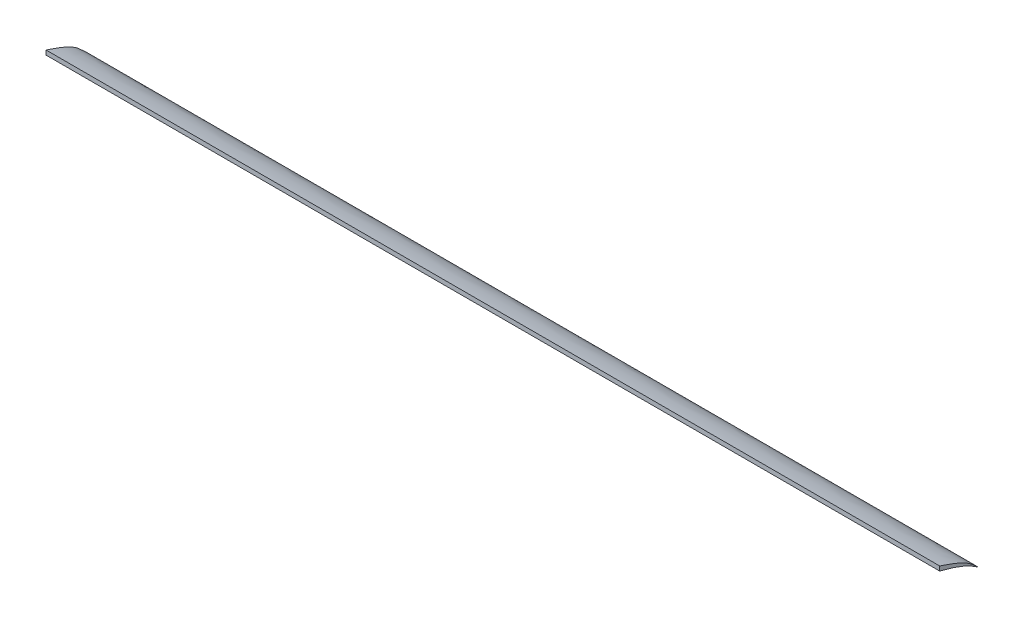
ISO-10303-21;
HEADER;
FILE_DESCRIPTION(('STEP AP214'),'2;1');
FILE_NAME('part.step','',(''),(''),'','','');
FILE_SCHEMA(('AUTOMOTIVE_DESIGN { 1 0 10303 214 1 1 1 1 }'));
ENDSEC;
DATA;
#1=APPLICATION_CONTEXT('core data for automotive mechanical design processes');
#2=APPLICATION_PROTOCOL_DEFINITION('international standard','automotive_design',2000,#1);
#3=PRODUCT_CONTEXT('',#1,'mechanical');
#4=PRODUCT('Part','Part','',(#3));
#5=PRODUCT_RELATED_PRODUCT_CATEGORY('part','',(#4));
#6=PRODUCT_DEFINITION_FORMATION('','',#4);
#7=PRODUCT_DEFINITION_CONTEXT('part definition',#1,'design');
#8=PRODUCT_DEFINITION('design','',#6,#7);
#9=PRODUCT_DEFINITION_SHAPE('','',#8);
#10=(LENGTH_UNIT() NAMED_UNIT(*) SI_UNIT(.MILLI.,.METRE.));
#11=(NAMED_UNIT(*) PLANE_ANGLE_UNIT() SI_UNIT($,.RADIAN.));
#12=(NAMED_UNIT(*) SI_UNIT($,.STERADIAN.) SOLID_ANGLE_UNIT());
#13=UNCERTAINTY_MEASURE_WITH_UNIT(LENGTH_MEASURE(1.E-05),#10,'distance_accuracy_value','');
#14=(GEOMETRIC_REPRESENTATION_CONTEXT(3) GLOBAL_UNCERTAINTY_ASSIGNED_CONTEXT((#13)) GLOBAL_UNIT_ASSIGNED_CONTEXT((#10,
#11,#12)) REPRESENTATION_CONTEXT('',''));
#15=CARTESIAN_POINT('',(0.,0.,0.));
#16=DIRECTION('',(0.,0.,1.));
#17=DIRECTION('',(1.,0.,0.));
#18=AXIS2_PLACEMENT_3D('',#15,#16,#17);
#19=CARTESIAN_POINT('',(147.6375,5.1954823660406,-133.35));
#20=CARTESIAN_POINT('',(147.6375,5.11582965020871,-133.673348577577));
#21=CARTESIAN_POINT('',(147.6375,4.71037481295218,-135.277577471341));
#22=CARTESIAN_POINT('',(147.6375,3.95188792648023,-137.924684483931));
#23=CARTESIAN_POINT('',(147.6375,2.79506562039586,-141.02126084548));
#24=CARTESIAN_POINT('',(147.6375,1.73664012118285,-143.230508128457));
#25=CARTESIAN_POINT('',(147.6375,0.758126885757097,-144.859258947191));
#26=CARTESIAN_POINT('',(147.6375,0.37945999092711,-145.484954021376));
#27=CARTESIAN_POINT('',(147.6375,-0.00379326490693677,-146.049106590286));
#28=CARTESIAN_POINT('',(147.6375,-3.4738986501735E-08,-146.049999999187));
#29=CARTESIAN_POINT('',(147.6375,0.00371761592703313,-146.050875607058));
#30=CARTESIAN_POINT('',(147.6375,0.361598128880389,-145.570888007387));
#31=CARTESIAN_POINT('',(147.6375,0.760133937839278,-145.164984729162));
#32=CARTESIAN_POINT('',(147.6375,1.59257287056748,-144.263697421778));
#33=CARTESIAN_POINT('',(147.6375,2.47816471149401,-143.200355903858));
#34=CARTESIAN_POINT('',(147.6375,3.37107158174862,-141.745686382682));
#35=CARTESIAN_POINT('',(147.6375,4.23653673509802,-139.936709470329));
#36=CARTESIAN_POINT('',(147.6375,5.13985636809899,-137.752799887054));
#37=CARTESIAN_POINT('',(147.6375,5.95313441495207,-135.514663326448));
#38=CARTESIAN_POINT('',(147.6375,6.45448002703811,-134.002837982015));
#39=CARTESIAN_POINT('',(147.6375,6.66369887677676,-133.35));
#40=B_SPLINE_CURVE_WITH_KNOTS('',3,(#19,#20,#21,#22,#23,#24,#25,#26,#27,#28,#29,#30,#31,#32,#33,
#34,#35,#36,#37,#38,#39),.UNSPECIFIED.,.F.,.F.,(4,1,1,1,1,1,1,3,1,1,1,1,1,1,1,1,4),
(0.954903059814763,0.958169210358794,0.971135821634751,0.981955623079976,0.990251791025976,
0.995852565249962,0.999000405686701,1.,1.00097967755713,1.00364886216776,1.00748349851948,
1.01209527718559,1.01752559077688,1.02405177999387,1.03178305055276,1.04067782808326,
1.04739946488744),.UNSPECIFIED.);
#41=DIRECTION('',(-1.,0.,0.));
#42=VECTOR('',#41,1.);
#43=SURFACE_OF_LINEAR_EXTRUSION('',#40,#42);
#44=CARTESIAN_POINT('',(-147.6375,5.1954823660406,-133.35));
#45=CARTESIAN_POINT('',(-147.6375,5.11582965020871,-133.673348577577));
#46=CARTESIAN_POINT('',(-147.6375,4.71037481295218,-135.277577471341));
#47=CARTESIAN_POINT('',(-147.6375,3.95188792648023,-137.924684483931));
#48=CARTESIAN_POINT('',(-147.6375,2.79506562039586,-141.02126084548));
#49=CARTESIAN_POINT('',(-147.6375,1.73664012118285,-143.230508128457));
#50=CARTESIAN_POINT('',(-147.6375,0.758126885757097,-144.859258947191));
#51=CARTESIAN_POINT('',(-147.6375,0.37945999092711,-145.484954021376));
#52=CARTESIAN_POINT('',(-147.6375,-0.00379326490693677,-146.049106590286));
#53=CARTESIAN_POINT('',(-147.6375,-3.4738986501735E-08,-146.049999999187));
#54=CARTESIAN_POINT('',(-147.6375,0.00371761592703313,-146.050875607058));
#55=CARTESIAN_POINT('',(-147.6375,0.361598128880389,-145.570888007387));
#56=CARTESIAN_POINT('',(-147.6375,0.760133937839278,-145.164984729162));
#57=CARTESIAN_POINT('',(-147.6375,1.59257287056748,-144.263697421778));
#58=CARTESIAN_POINT('',(-147.6375,2.47816471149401,-143.200355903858));
#59=CARTESIAN_POINT('',(-147.6375,3.37107158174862,-141.745686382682));
#60=CARTESIAN_POINT('',(-147.6375,4.23653673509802,-139.936709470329));
#61=CARTESIAN_POINT('',(-147.6375,5.13985636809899,-137.752799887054));
#62=CARTESIAN_POINT('',(-147.6375,5.95313441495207,-135.514663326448));
#63=CARTESIAN_POINT('',(-147.6375,6.45448002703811,-134.002837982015));
#64=CARTESIAN_POINT('',(-147.6375,6.66369887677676,-133.35));
#65=B_SPLINE_CURVE_WITH_KNOTS('',3,(#44,#45,#46,#47,#48,#49,#50,#51,#52,#53,#54,#55,#56,#57,#58,
#59,#60,#61,#62,#63,#64),.UNSPECIFIED.,.F.,.F.,(4,1,1,1,1,1,1,3,1,1,1,1,1,1,1,1,4),
(0.954903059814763,0.958169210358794,0.971135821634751,0.981955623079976,0.990251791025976,
0.995852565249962,0.999000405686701,1.,1.00097967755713,1.00364886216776,1.00748349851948,
1.01209527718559,1.01752559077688,1.02405177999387,1.03178305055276,1.04067782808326,
1.04739946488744),.UNSPECIFIED.);
#66=CARTESIAN_POINT('',(-147.6375,5.1954823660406,-133.35));
#67=VERTEX_POINT('',#66);
#68=CARTESIAN_POINT('',(-147.6375,6.66369887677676,-133.35));
#69=VERTEX_POINT('',#68);
#70=EDGE_CURVE('E65',#67,#69,#65,.T.);
#71=ORIENTED_EDGE('',*,*,#70,.T.);
#72=DIRECTION('',(-1.,0.,0.));
#73=VECTOR('',#72,1.);
#74=CARTESIAN_POINT('',(147.6375,6.66369887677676,-133.35));
#75=LINE('',#74,#73);
#76=CARTESIAN_POINT('',(147.6375,6.66369887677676,-133.35));
#77=VERTEX_POINT('',#76);
#78=EDGE_CURVE('E11',#77,#69,#75,.T.);
#79=ORIENTED_EDGE('',*,*,#78,.F.);
#80=CARTESIAN_POINT('',(147.6375,5.1954823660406,-133.35));
#81=VERTEX_POINT('',#80);
#82=EDGE_CURVE('E64',#81,#77,#40,.T.);
#83=ORIENTED_EDGE('',*,*,#82,.F.);
#84=DIRECTION('',(-1.,0.,0.));
#85=VECTOR('',#84,1.);
#86=CARTESIAN_POINT('',(147.6375,5.1954823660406,-133.35));
#87=LINE('',#86,#85);
#88=EDGE_CURVE('E42',#81,#67,#87,.T.);
#89=ORIENTED_EDGE('',*,*,#88,.T.);
#90=EDGE_LOOP('',(#71,#79,#83,#89));
#91=FACE_BOUND('',#90,.T.);
#92=ADVANCED_FACE('F33',(#91),#43,.F.);
#93=CARTESIAN_POINT('',(147.6375,5.1954823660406,-133.35));
#94=DIRECTION('',(0.,0.,-1.));
#95=DIRECTION('',(0.,1.,0.));
#96=AXIS2_PLACEMENT_3D('',#93,#94,#95);
#97=PLANE('',#96);
#98=DIRECTION('',(0.,-1.,0.));
#99=VECTOR('',#98,1.);
#100=CARTESIAN_POINT('',(-147.6375,5.1954823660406,-133.35));
#101=LINE('',#100,#99);
#102=EDGE_CURVE('E57',#69,#67,#101,.T.);
#103=ORIENTED_EDGE('',*,*,#102,.T.);
#104=ORIENTED_EDGE('',*,*,#88,.F.);
#105=DIRECTION('',(0.,-1.,0.));
#106=VECTOR('',#105,1.);
#107=CARTESIAN_POINT('',(147.6375,5.1954823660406,-133.35));
#108=LINE('',#107,#106);
#109=EDGE_CURVE('E49',#77,#81,#108,.T.);
#110=ORIENTED_EDGE('',*,*,#109,.F.);
#111=ORIENTED_EDGE('',*,*,#78,.T.);
#112=EDGE_LOOP('',(#103,#104,#110,#111));
#113=FACE_BOUND('',#112,.T.);
#114=ADVANCED_FACE('F60',(#113),#97,.F.);
#115=CARTESIAN_POINT('',(147.6375,0.227337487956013,-145.758261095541));
#116=DIRECTION('',(1.,0.,0.));
#117=DIRECTION('',(0.,0.,-1.));
#118=AXIS2_PLACEMENT_3D('',#115,#116,#117);
#119=PLANE('',#118);
#120=ORIENTED_EDGE('',*,*,#82,.T.);
#121=ORIENTED_EDGE('',*,*,#109,.T.);
#122=EDGE_LOOP('',(#120,#121));
#123=FACE_BOUND('',#122,.T.);
#124=ADVANCED_FACE('F82',(#123),#119,.T.);
#125=CARTESIAN_POINT('',(-147.6375,0.227337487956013,-145.758261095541));
#126=DIRECTION('',(1.,0.,0.));
#127=DIRECTION('',(0.,0.,-1.));
#128=AXIS2_PLACEMENT_3D('',#125,#126,#127);
#129=PLANE('',#128);
#130=ORIENTED_EDGE('',*,*,#70,.F.);
#131=ORIENTED_EDGE('',*,*,#102,.F.);
#132=EDGE_LOOP('',(#130,#131));
#133=FACE_BOUND('',#132,.T.);
#134=ADVANCED_FACE('F68',(#133),#129,.F.);
#135=CLOSED_SHELL('',(#92,#114,#124,#134));
#136=MANIFOLD_SOLID_BREP('B2',#135);
#137=ADVANCED_BREP_SHAPE_REPRESENTATION('',(#18,#136),#14);
#138=SHAPE_DEFINITION_REPRESENTATION(#9,#137);
ENDSEC;
END-ISO-10303-21;
